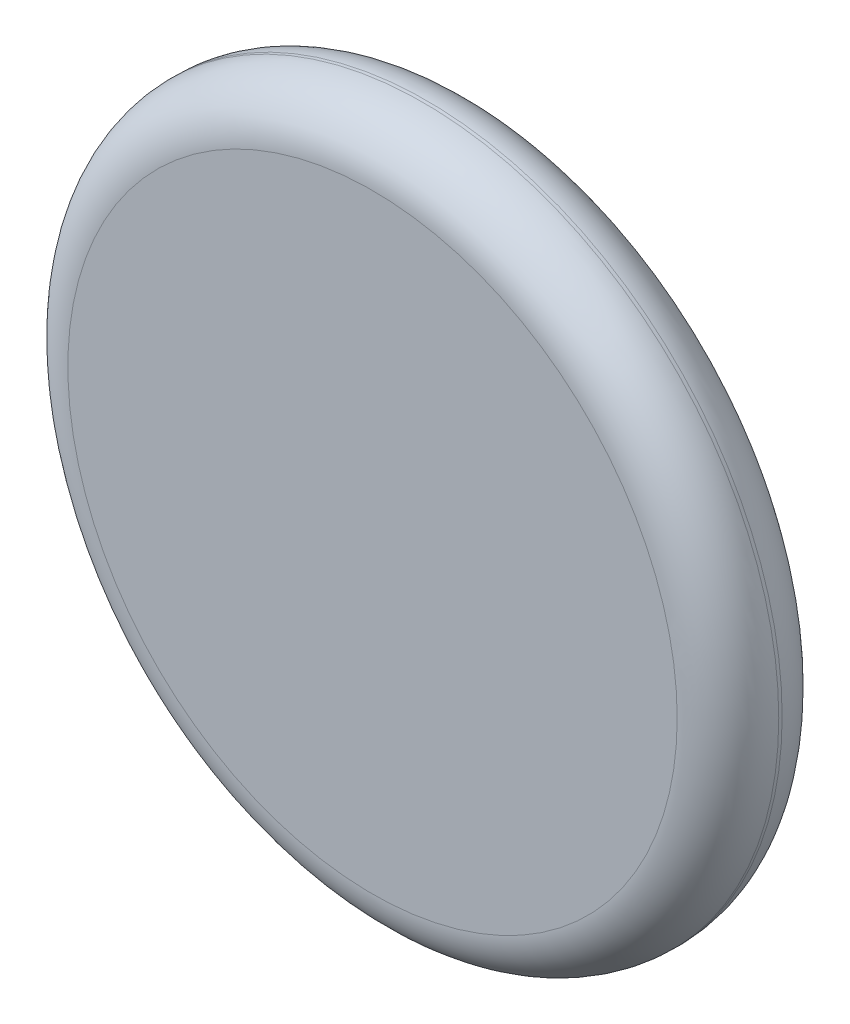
from build123d import *

# Parameters (mm, degrees)
SKETCH1_R           = 21
BOSS_EXTRUDE1_DEPTH = 6.2
FILLET1_R           = 3
SKETCH2_R           = 1
CUT_EXTRUDE1_DEPTH  = 2


with BuildPart() as part:
    # Sketch1 → Boss-Extrude1 (new body)
    with BuildSketch(Plane.XY):
        with Locations(Location((0, 0, 0), (0, 0, 180))):
            Circle(SKETCH1_R)
    extrude(amount=BOSS_EXTRUDE1_DEPTH)

    # Fillet1
    fillet1_edges = [part.edges().sort_by_distance(p)[0] for p in [
        (21, 0, 0),
        (21, 0, 6.2),
    ]]
    fillet(fillet1_edges, radius=FILLET1_R)

    # Sketch2 → Cut-Extrude1 (cut)
    with BuildSketch(Plane(origin=(0, 0, 0), x_dir=(-1, 0, 0), z_dir=(0, 0, -1))):
        Circle(SKETCH2_R)
    extrude(amount=-CUT_EXTRUDE1_DEPTH, mode=Mode.SUBTRACT)


solid = part.part
